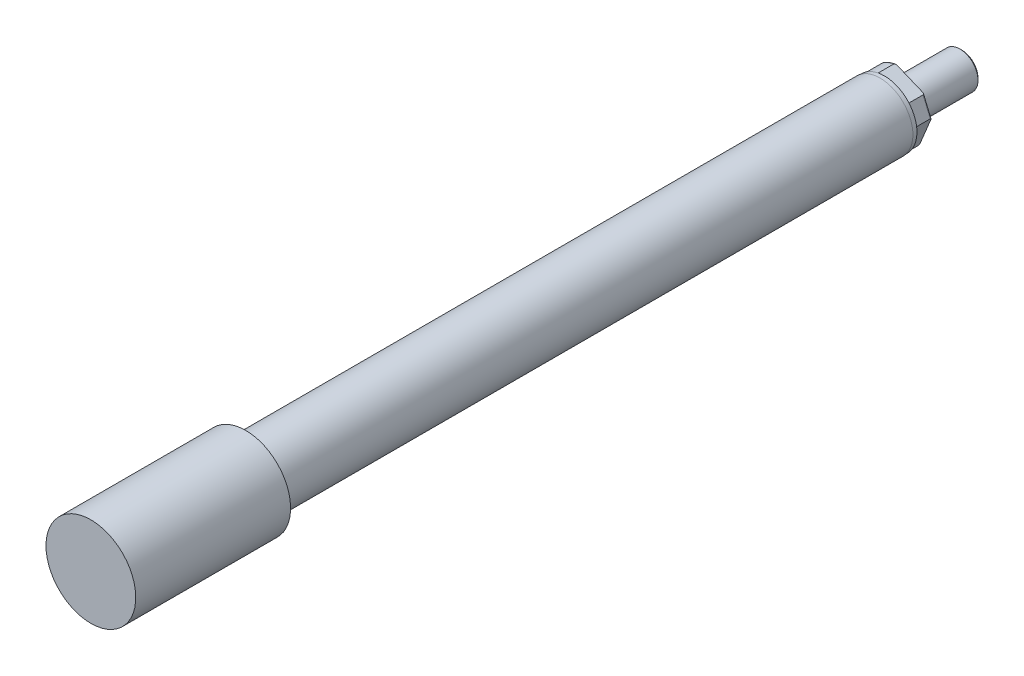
ISO-10303-21;
HEADER;
FILE_DESCRIPTION(('STEP AP214'),'2;1');
FILE_NAME('part.step','',(''),(''),'','','');
FILE_SCHEMA(('AUTOMOTIVE_DESIGN { 1 0 10303 214 1 1 1 1 }'));
ENDSEC;
DATA;
#1=APPLICATION_CONTEXT('core data for automotive mechanical design processes');
#2=APPLICATION_PROTOCOL_DEFINITION('international standard','automotive_design',2000,#1);
#3=PRODUCT_CONTEXT('',#1,'mechanical');
#4=PRODUCT('Part','Part','',(#3));
#5=PRODUCT_RELATED_PRODUCT_CATEGORY('part','',(#4));
#6=PRODUCT_DEFINITION_FORMATION('','',#4);
#7=PRODUCT_DEFINITION_CONTEXT('part definition',#1,'design');
#8=PRODUCT_DEFINITION('design','',#6,#7);
#9=PRODUCT_DEFINITION_SHAPE('','',#8);
#10=(LENGTH_UNIT() NAMED_UNIT(*) SI_UNIT(.MILLI.,.METRE.));
#11=(NAMED_UNIT(*) PLANE_ANGLE_UNIT() SI_UNIT($,.RADIAN.));
#12=(NAMED_UNIT(*) SI_UNIT($,.STERADIAN.) SOLID_ANGLE_UNIT());
#13=UNCERTAINTY_MEASURE_WITH_UNIT(LENGTH_MEASURE(1.E-05),#10,'distance_accuracy_value','');
#14=(GEOMETRIC_REPRESENTATION_CONTEXT(3) GLOBAL_UNCERTAINTY_ASSIGNED_CONTEXT((#13)) GLOBAL_UNIT_ASSIGNED_CONTEXT((#10,
#11,#12)) REPRESENTATION_CONTEXT('',''));
#15=CARTESIAN_POINT('',(0.,0.,0.));
#16=DIRECTION('',(0.,0.,1.));
#17=DIRECTION('',(1.,0.,0.));
#18=AXIS2_PLACEMENT_3D('',#15,#16,#17);
#19=CARTESIAN_POINT('',(0.,0.,-710.03280000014));
#20=DIRECTION('',(0.,0.,1.));
#21=DIRECTION('',(0.923879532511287,-0.382683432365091,0.));
#22=AXIS2_PLACEMENT_3D('',#19,#20,#21);
#23=CYLINDRICAL_SURFACE('',#22,37.719);
#24=CARTESIAN_POINT('',(0.,0.,-770.18000000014));
#25=DIRECTION('',(0.,0.,1.));
#26=DIRECTION('',(0.923879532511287,-0.382683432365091,0.));
#27=AXIS2_PLACEMENT_3D('',#24,#25,#26);
#28=CIRCLE('',#27,37.719);
#29=CARTESIAN_POINT('',(34.8478120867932,-14.4344363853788,-770.18000000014));
#30=VERTEX_POINT('',#29);
#31=EDGE_CURVE('E137',#30,#30,#28,.T.);
#32=ORIENTED_EDGE('',*,*,#31,.F.);
#33=EDGE_LOOP('',(#32));
#34=FACE_BOUND('',#33,.T.);
#35=CARTESIAN_POINT('',(0.,0.,-775.18000000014));
#36=DIRECTION('',(0.,0.,-1.));
#37=DIRECTION('',(-0.923879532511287,0.382683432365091,0.));
#38=AXIS2_PLACEMENT_3D('',#35,#36,#37);
#39=CIRCLE('',#38,37.719);
#40=CARTESIAN_POINT('',(-34.8478120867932,14.4344363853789,-775.18000000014));
#41=VERTEX_POINT('',#40);
#42=EDGE_CURVE('E173',#41,#41,#39,.T.);
#43=ORIENTED_EDGE('',*,*,#42,.F.);
#44=EDGE_LOOP('',(#43));
#45=FACE_BOUND('',#44,.T.);
#46=ADVANCED_FACE('F16',(#34,#45),#23,.T.);
#47=CARTESIAN_POINT('',(14.4344363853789,34.8478120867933,-795.18000000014));
#48=DIRECTION('',(0.,0.,1.));
#49=DIRECTION('',(0.923879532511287,-0.382683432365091,0.));
#50=AXIS2_PLACEMENT_3D('',#47,#48,#49);
#51=PLANE('',#50);
#52=CARTESIAN_POINT('',(0.,0.,-795.18000000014));
#53=DIRECTION('',(0.,0.,1.));
#54=DIRECTION('',(0.923879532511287,-0.382683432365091,0.));
#55=AXIS2_PLACEMENT_3D('',#52,#53,#54);
#56=CIRCLE('',#55,18.495999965);
#57=CARTESIAN_POINT('',(17.088075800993,-7.07811275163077,-795.18000000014));
#58=VERTEX_POINT('',#57);
#59=EDGE_CURVE('E158',#58,#58,#56,.T.);
#60=ORIENTED_EDGE('',*,*,#59,.T.);
#61=EDGE_LOOP('',(#60));
#62=FACE_BOUND('',#61,.T.);
#63=DIRECTION('',(0.923879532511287,-0.382683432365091,0.));
#64=VECTOR('',#63,1.);
#65=CARTESIAN_POINT('',(40.5034519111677,16.7770791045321,-795.18000000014));
#66=LINE('',#65,#64);
#67=CARTESIAN_POINT('',(-4.93911886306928,35.6000082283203,-795.18000000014));
#68=VERTEX_POINT('',#67);
#69=CARTESIAN_POINT('',(24.3744280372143,23.4579395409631,-795.18000000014));
#70=VERTEX_POINT('',#69);
#71=EDGE_CURVE('E153',#68,#70,#66,.T.);
#72=ORIENTED_EDGE('',*,*,#71,.T.);
#73=DIRECTION('',(-0.382683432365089,0.923879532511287,0.));
#74=VECTOR('',#73,1.);
#75=CARTESIAN_POINT('',(18.8918219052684,36.6941216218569,-795.18000000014));
#76=LINE('',#75,#74);
#77=CARTESIAN_POINT('',(33.8225914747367,0.648055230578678,-795.18000000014));
#78=VERTEX_POINT('',#77);
#79=EDGE_CURVE('E269',#70,#78,#76,.F.);
#80=ORIENTED_EDGE('',*,*,#79,.T.);
#81=DIRECTION('',(-0.382683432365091,-0.923879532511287,0.));
#82=VECTOR('',#81,1.);
#83=CARTESIAN_POINT('',(40.5034519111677,16.7770791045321,-795.18000000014));
#84=LINE('',#83,#82);
#85=CARTESIAN_POINT('',(21.6805227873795,-28.6654916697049,-795.18000000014));
#86=VERTEX_POINT('',#85);
#87=EDGE_CURVE('E143',#78,#86,#84,.T.);
#88=ORIENTED_EDGE('',*,*,#87,.T.);
#89=CARTESIAN_POINT('',(0.,0.,-795.18000000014));
#90=DIRECTION('',(0.,0.,1.));
#91=DIRECTION('',(0.923879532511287,-0.382683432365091,0.));
#92=AXIS2_PLACEMENT_3D('',#89,#90,#91);
#93=CIRCLE('',#92,35.941);
#94=CARTESIAN_POINT('',(4.93911886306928,-35.6000082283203,-795.18000000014));
#95=VERTEX_POINT('',#94);
#96=EDGE_CURVE('E284',#86,#95,#93,.F.);
#97=ORIENTED_EDGE('',*,*,#96,.T.);
#98=DIRECTION('',(-0.923879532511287,0.382683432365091,0.));
#99=VECTOR('',#98,1.);
#100=CARTESIAN_POINT('',(16.7770791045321,-40.5034519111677,-795.18000000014));
#101=LINE('',#100,#99);
#102=CARTESIAN_POINT('',(-28.6654916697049,-21.6805227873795,-795.18000000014));
#103=VERTEX_POINT('',#102);
#104=EDGE_CURVE('E146',#95,#103,#101,.T.);
#105=ORIENTED_EDGE('',*,*,#104,.T.);
#106=CARTESIAN_POINT('',(0.,0.,-795.18000000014));
#107=DIRECTION('',(0.,0.,1.));
#108=DIRECTION('',(0.923879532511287,-0.382683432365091,0.));
#109=AXIS2_PLACEMENT_3D('',#106,#107,#108);
#110=CIRCLE('',#109,35.941);
#111=CARTESIAN_POINT('',(-35.6000082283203,-4.93911886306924,-795.18000000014));
#112=VERTEX_POINT('',#111);
#113=EDGE_CURVE('E282',#103,#112,#110,.F.);
#114=ORIENTED_EDGE('',*,*,#113,.T.);
#115=DIRECTION('',(0.382683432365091,0.923879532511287,0.));
#116=VECTOR('',#115,1.);
#117=CARTESIAN_POINT('',(-16.777079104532,40.5034519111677,-795.18000000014));
#118=LINE('',#117,#116);
#119=CARTESIAN_POINT('',(-21.6805227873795,28.6654916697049,-795.18000000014));
#120=VERTEX_POINT('',#119);
#121=EDGE_CURVE('E150',#112,#120,#118,.T.);
#122=ORIENTED_EDGE('',*,*,#121,.T.);
#123=CARTESIAN_POINT('',(0.,0.,-795.18000000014));
#124=DIRECTION('',(0.,0.,1.));
#125=DIRECTION('',(0.923879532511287,-0.382683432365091,0.));
#126=AXIS2_PLACEMENT_3D('',#123,#124,#125);
#127=CIRCLE('',#126,35.941);
#128=EDGE_CURVE('E285',#120,#68,#127,.F.);
#129=ORIENTED_EDGE('',*,*,#128,.T.);
#130=EDGE_LOOP('',(#72,#80,#88,#97,#105,#114,#122,#129));
#131=FACE_BOUND('',#130,.T.);
#132=ADVANCED_FACE('F235',(#62,#131),#51,.F.);
#133=CARTESIAN_POINT('',(16.7770791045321,-40.5034519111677,-775.18000000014));
#134=DIRECTION('',(-0.382683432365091,-0.923879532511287,0.));
#135=DIRECTION('',(0.,0.,-1.));
#136=AXIS2_PLACEMENT_3D('',#133,#134,#135);
#137=PLANE('',#136);
#138=ORIENTED_EDGE('',*,*,#104,.F.);
#139=CARTESIAN_POINT('',(4.93911886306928,-35.6000082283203,-795.18000000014));
#140=CARTESIAN_POINT('',(4.99832987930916,-35.6245342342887,-795.179997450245));
#141=CARTESIAN_POINT('',(5.05753718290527,-35.6490587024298,-795.178965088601));
#142=CARTESIAN_POINT('',(5.17589592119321,-35.698084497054,-795.174771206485));
#143=CARTESIAN_POINT('',(5.23504734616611,-35.7225858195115,-795.171609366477));
#144=CARTESIAN_POINT('',(5.41269190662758,-35.7961686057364,-795.158798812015));
#145=CARTESIAN_POINT('',(5.53100031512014,-35.8451735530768,-795.145824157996));
#146=CARTESIAN_POINT('',(5.76714438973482,-35.9429876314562,-795.110075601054));
#147=CARTESIAN_POINT('',(5.88497196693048,-35.9917934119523,-795.087238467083));
#148=CARTESIAN_POINT('',(6.11821347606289,-36.0884052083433,-795.030530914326));
#149=CARTESIAN_POINT('',(6.23363092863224,-36.1362126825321,-794.996677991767));
#150=CARTESIAN_POINT('',(6.43254813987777,-36.2186068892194,-794.926075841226));
#151=CARTESIAN_POINT('',(6.51688700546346,-36.2535411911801,-794.89210972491));
#152=CARTESIAN_POINT('',(6.68230923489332,-36.322061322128,-794.815821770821));
#153=CARTESIAN_POINT('',(6.76339350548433,-36.3556475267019,-794.773502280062));
#154=CARTESIAN_POINT('',(6.92130537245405,-36.4210567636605,-794.678775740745));
#155=CARTESIAN_POINT('',(6.99809311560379,-36.4528632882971,-794.626289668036));
#156=CARTESIAN_POINT('',(7.14387346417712,-36.5132474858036,-794.509776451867));
#157=CARTESIAN_POINT('',(7.21288086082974,-36.5418312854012,-794.445771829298));
#158=CARTESIAN_POINT('',(7.31526105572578,-36.5842385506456,-794.330741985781));
#159=CARTESIAN_POINT('',(7.35238511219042,-36.5996158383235,-794.283646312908));
#160=CARTESIAN_POINT('',(7.41994876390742,-36.6276016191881,-794.184077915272));
#161=CARTESIAN_POINT('',(7.45039435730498,-36.6402125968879,-794.131610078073));
#162=CARTESIAN_POINT('',(7.49865078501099,-36.6602010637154,-794.029833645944));
#163=CARTESIAN_POINT('',(7.51766185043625,-36.6680757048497,-793.981197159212));
#164=CARTESIAN_POINT('',(7.54789053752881,-36.6805968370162,-793.8811948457));
#165=CARTESIAN_POINT('',(7.55912658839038,-36.6852509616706,-793.829835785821));
#166=CARTESIAN_POINT('',(7.56865990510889,-36.6891997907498,-793.757679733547));
#167=CARTESIAN_POINT('',(7.57066753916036,-36.6900313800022,-793.737405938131));
#168=CARTESIAN_POINT('',(7.57334922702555,-36.691142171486,-793.696758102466));
#169=CARTESIAN_POINT('',(7.57402345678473,-36.6914214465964,-793.676384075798));
#170=CARTESIAN_POINT('',(7.57402314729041,-36.6914213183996,-793.65600000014));
#171=B_SPLINE_CURVE_WITH_KNOTS('',3,(#139,#140,#141,#142,#143,#144,#145,#146,#147,#148,#149,
#150,#151,#152,#153,#154,#155,#156,#157,#158,#159,#160,#161,#162,#163,#164,#165,#166,#167,#168,
#169,#170),.UNSPECIFIED.,.F.,.F.,(4,2,2,2,2,2,2,2,2,2,2,2,2,2,2,4),(0.,0.19225105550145,
0.384530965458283,0.770306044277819,1.15859203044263,1.54626429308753,1.83813426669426,
2.12992235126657,2.42407675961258,2.71766216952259,2.90288017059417,3.08793113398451,
3.24573831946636,3.40317015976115,3.46429781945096,3.52541741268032),.UNSPECIFIED.);
#172=CARTESIAN_POINT('',(7.5740231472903,-36.6914213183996,-793.65600000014));
#173=VERTEX_POINT('',#172);
#174=EDGE_CURVE('E248',#95,#173,#171,.T.);
#175=ORIENTED_EDGE('',*,*,#174,.T.);
#176=DIRECTION('',(0.,0.,-1.));
#177=VECTOR('',#176,1.);
#178=CARTESIAN_POINT('',(7.5740231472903,-36.6914213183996,-667.427702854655));
#179=LINE('',#178,#177);
#180=CARTESIAN_POINT('',(7.5740231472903,-36.6914213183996,-775.18000000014));
#181=VERTEX_POINT('',#180);
#182=EDGE_CURVE('E316',#173,#181,#179,.F.);
#183=ORIENTED_EDGE('',*,*,#182,.T.);
#184=DIRECTION('',(-0.923879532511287,0.382683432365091,0.));
#185=VECTOR('',#184,1.);
#186=CARTESIAN_POINT('',(16.7770791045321,-40.5034519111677,-775.18000000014));
#187=LINE('',#186,#185);
#188=CARTESIAN_POINT('',(-31.3003959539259,-20.5891096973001,-775.18000000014));
#189=VERTEX_POINT('',#188);
#190=EDGE_CURVE('E134',#181,#189,#187,.T.);
#191=ORIENTED_EDGE('',*,*,#190,.T.);
#192=DIRECTION('',(0.,0.,-1.));
#193=VECTOR('',#192,1.);
#194=CARTESIAN_POINT('',(-31.3003959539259,-20.5891096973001,-667.427702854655));
#195=LINE('',#194,#193);
#196=CARTESIAN_POINT('',(-31.3003959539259,-20.5891096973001,-793.65600000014));
#197=VERTEX_POINT('',#196);
#198=EDGE_CURVE('E121',#189,#197,#195,.T.);
#199=ORIENTED_EDGE('',*,*,#198,.T.);
#200=CARTESIAN_POINT('',(-31.3003959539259,-20.5891096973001,-793.65600000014));
#201=CARTESIAN_POINT('',(-31.3004118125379,-20.5891031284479,-793.686203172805));
#202=CARTESIAN_POINT('',(-31.2989193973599,-20.5897213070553,-793.716395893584));
#203=CARTESIAN_POINT('',(-31.2930415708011,-20.5921559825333,-793.776407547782));
#204=CARTESIAN_POINT('',(-31.2886603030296,-20.5939707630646,-793.806226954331));
#205=CARTESIAN_POINT('',(-31.2772021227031,-20.598716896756,-793.864846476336));
#206=CARTESIAN_POINT('',(-31.270160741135,-20.6016335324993,-793.893654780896));
#207=CARTESIAN_POINT('',(-31.2535839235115,-20.60849987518,-793.950415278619));
#208=CARTESIAN_POINT('',(-31.2440477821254,-20.6124498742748,-793.978367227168));
#209=CARTESIAN_POINT('',(-31.2121642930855,-20.6256564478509,-794.060335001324));
#210=CARTESIAN_POINT('',(-31.1864612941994,-20.6363029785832,-794.112849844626));
#211=CARTESIAN_POINT('',(-31.127980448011,-20.6605265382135,-794.213146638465));
#212=CARTESIAN_POINT('',(-31.0951775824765,-20.6741139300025,-794.260910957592));
#213=CARTESIAN_POINT('',(-31.003724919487,-20.7119948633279,-794.377743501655));
#214=CARTESIAN_POINT('',(-30.941099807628,-20.7379350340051,-794.443153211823));
#215=CARTESIAN_POINT('',(-30.807443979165,-20.7932970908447,-794.562855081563));
#216=CARTESIAN_POINT('',(-30.7363963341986,-20.8227259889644,-794.617124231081));
#217=CARTESIAN_POINT('',(-30.5996359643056,-20.8793739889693,-794.708806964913));
#218=CARTESIAN_POINT('',(-30.5346551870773,-20.9062899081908,-794.747524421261));
#219=CARTESIAN_POINT('',(-30.4018382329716,-20.9613044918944,-794.818793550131));
#220=CARTESIAN_POINT('',(-30.33399999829,-20.989404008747,-794.851340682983));
#221=CARTESIAN_POINT('',(-30.1960424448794,-21.0465478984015,-794.911059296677));
#222=CARTESIAN_POINT('',(-30.1259151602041,-21.0755955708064,-794.938208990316));
#223=CARTESIAN_POINT('',(-29.9841814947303,-21.1343035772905,-794.987552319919));
#224=CARTESIAN_POINT('',(-29.9125747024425,-21.1639640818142,-795.00974455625));
#225=CARTESIAN_POINT('',(-29.7438693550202,-21.2338441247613,-795.056387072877));
#226=CARTESIAN_POINT('',(-29.6463506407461,-21.2742376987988,-795.079056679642));
#227=CARTESIAN_POINT('',(-29.4500861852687,-21.3555330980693,-795.117195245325));
#228=CARTESIAN_POINT('',(-29.351339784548,-21.3964351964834,-795.132660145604));
#229=CARTESIAN_POINT('',(-29.1548151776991,-21.4778383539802,-795.156800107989));
#230=CARTESIAN_POINT('',(-29.0570481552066,-21.5183347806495,-795.165583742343));
#231=CARTESIAN_POINT('',(-28.861343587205,-21.5993982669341,-795.177167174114));
#232=CARTESIAN_POINT('',(-28.7634064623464,-21.6399651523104,-795.17997520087));
#233=CARTESIAN_POINT('',(-28.6654916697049,-21.6805227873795,-795.18000000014));
#234=B_SPLINE_CURVE_WITH_KNOTS('',3,(#200,#201,#202,#203,#204,#205,#206,#207,#208,#209,#210,
#211,#212,#213,#214,#215,#216,#217,#218,#219,#220,#221,#222,#223,#224,#225,#226,#227,#228,#229,
#230,#231,#232,#233),.UNSPECIFIED.,.F.,.F.,(4,2,2,2,2,2,2,2,2,2,2,2,2,2,2,2,4),(0.,
0.0905495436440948,0.180969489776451,0.270222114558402,0.359500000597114,0.53688322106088,
0.714901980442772,0.995893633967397,1.27745994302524,1.51798351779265,1.75868337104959,
2.00033593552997,2.24205663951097,2.56564116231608,2.88940775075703,3.20779349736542,
3.52574049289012),.UNSPECIFIED.);
#235=EDGE_CURVE('E242',#197,#103,#234,.T.);
#236=ORIENTED_EDGE('',*,*,#235,.T.);
#237=EDGE_LOOP('',(#138,#175,#183,#191,#199,#236));
#238=FACE_BOUND('',#237,.T.);
#239=ADVANCED_FACE('F230',(#238),#137,.T.);
#240=CARTESIAN_POINT('',(-16.777079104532,40.5034519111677,-775.18000000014));
#241=DIRECTION('',(-0.923879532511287,0.382683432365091,0.));
#242=DIRECTION('',(-0.382683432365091,-0.923879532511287,0.));
#243=AXIS2_PLACEMENT_3D('',#240,#241,#242);
#244=PLANE('',#243);
#245=ORIENTED_EDGE('',*,*,#121,.F.);
#246=CARTESIAN_POINT('',(-35.6000082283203,-4.93911886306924,-795.18000000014));
#247=CARTESIAN_POINT('',(-35.6245342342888,-4.99832987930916,-795.179997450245));
#248=CARTESIAN_POINT('',(-35.6490587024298,-5.0575371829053,-795.178965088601));
#249=CARTESIAN_POINT('',(-35.6980844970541,-5.17589592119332,-795.174771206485));
#250=CARTESIAN_POINT('',(-35.7225858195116,-5.23504734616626,-795.171609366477));
#251=CARTESIAN_POINT('',(-35.7961686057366,-5.41269190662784,-795.158798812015));
#252=CARTESIAN_POINT('',(-35.845173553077,-5.53100031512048,-795.145824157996));
#253=CARTESIAN_POINT('',(-35.9429876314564,-5.76714438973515,-795.110075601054));
#254=CARTESIAN_POINT('',(-35.9917934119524,-5.88497196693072,-795.087238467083));
#255=CARTESIAN_POINT('',(-36.0884052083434,-6.11821347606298,-795.030530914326));
#256=CARTESIAN_POINT('',(-36.1362126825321,-6.23363092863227,-794.996677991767));
#257=CARTESIAN_POINT('',(-36.2186068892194,-6.43254813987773,-794.926075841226));
#258=CARTESIAN_POINT('',(-36.2535411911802,-6.5168870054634,-794.89210972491));
#259=CARTESIAN_POINT('',(-36.322061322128,-6.68230923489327,-794.815821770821));
#260=CARTESIAN_POINT('',(-36.355647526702,-6.76339350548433,-794.773502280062));
#261=CARTESIAN_POINT('',(-36.4210567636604,-6.9213053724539,-794.678775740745));
#262=CARTESIAN_POINT('',(-36.452863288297,-6.99809311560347,-794.626289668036));
#263=CARTESIAN_POINT('',(-36.5132474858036,-7.14387346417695,-794.509776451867));
#264=CARTESIAN_POINT('',(-36.5418312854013,-7.21288086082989,-794.445771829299));
#265=CARTESIAN_POINT('',(-36.5842385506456,-7.31526105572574,-794.330741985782));
#266=CARTESIAN_POINT('',(-36.5996158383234,-7.35238511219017,-794.283646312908));
#267=CARTESIAN_POINT('',(-36.627601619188,-7.41994876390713,-794.184077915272));
#268=CARTESIAN_POINT('',(-36.6402125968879,-7.45039435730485,-794.131610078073));
#269=CARTESIAN_POINT('',(-36.6602010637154,-7.49865078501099,-794.029833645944));
#270=CARTESIAN_POINT('',(-36.6680757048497,-7.51766185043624,-793.981197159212));
#271=CARTESIAN_POINT('',(-36.6805968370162,-7.54789053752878,-793.8811948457));
#272=CARTESIAN_POINT('',(-36.6852509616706,-7.55912658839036,-793.829835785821));
#273=CARTESIAN_POINT('',(-36.6891997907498,-7.56865990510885,-793.757679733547));
#274=CARTESIAN_POINT('',(-36.6900313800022,-7.57066753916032,-793.737405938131));
#275=CARTESIAN_POINT('',(-36.691142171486,-7.5733492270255,-793.696758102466));
#276=CARTESIAN_POINT('',(-36.6914214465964,-7.57402345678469,-793.676384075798));
#277=CARTESIAN_POINT('',(-36.6914213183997,-7.57402314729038,-793.65600000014));
#278=B_SPLINE_CURVE_WITH_KNOTS('',3,(#246,#247,#248,#249,#250,#251,#252,#253,#254,#255,#256,
#257,#258,#259,#260,#261,#262,#263,#264,#265,#266,#267,#268,#269,#270,#271,#272,#273,#274,#275,
#276,#277),.UNSPECIFIED.,.F.,.F.,(4,2,2,2,2,2,2,2,2,2,2,2,2,2,2,4),(0.,0.192251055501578,
0.384530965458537,0.770306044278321,1.15859203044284,1.54626429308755,1.83813426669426,
2.12992235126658,2.4240767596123,2.71766216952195,2.90288017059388,3.08793113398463,
3.24573831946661,3.40317015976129,3.46429781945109,3.52541741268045),.UNSPECIFIED.);
#279=CARTESIAN_POINT('',(-36.6914213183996,-7.57402314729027,-793.65600000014));
#280=VERTEX_POINT('',#279);
#281=EDGE_CURVE('E33',#112,#280,#278,.T.);
#282=ORIENTED_EDGE('',*,*,#281,.T.);
#283=DIRECTION('',(0.,0.,-1.));
#284=VECTOR('',#283,1.);
#285=CARTESIAN_POINT('',(-36.6914213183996,-7.57402314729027,-667.427702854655));
#286=LINE('',#285,#284);
#287=CARTESIAN_POINT('',(-36.6914213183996,-7.57402314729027,-775.18000000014));
#288=VERTEX_POINT('',#287);
#289=EDGE_CURVE('E107',#280,#288,#286,.F.);
#290=ORIENTED_EDGE('',*,*,#289,.T.);
#291=DIRECTION('',(0.382683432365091,0.923879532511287,0.));
#292=VECTOR('',#291,1.);
#293=CARTESIAN_POINT('',(-16.777079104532,40.5034519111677,-775.18000000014));
#294=LINE('',#293,#292);
#295=CARTESIAN_POINT('',(-20.5891096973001,31.3003959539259,-775.18000000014));
#296=VERTEX_POINT('',#295);
#297=EDGE_CURVE('E111',#288,#296,#294,.T.);
#298=ORIENTED_EDGE('',*,*,#297,.T.);
#299=DIRECTION('',(0.,0.,-1.));
#300=VECTOR('',#299,1.);
#301=CARTESIAN_POINT('',(-20.5891096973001,31.3003959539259,-667.427702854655));
#302=LINE('',#301,#300);
#303=CARTESIAN_POINT('',(-20.5891096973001,31.3003959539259,-793.65600000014));
#304=VERTEX_POINT('',#303);
#305=EDGE_CURVE('E114',#296,#304,#302,.T.);
#306=ORIENTED_EDGE('',*,*,#305,.T.);
#307=CARTESIAN_POINT('',(-20.5891096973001,31.3003959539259,-793.65600000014));
#308=CARTESIAN_POINT('',(-20.5891031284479,31.300411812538,-793.686203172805));
#309=CARTESIAN_POINT('',(-20.5897213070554,31.29891939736,-793.716395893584));
#310=CARTESIAN_POINT('',(-20.5921559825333,31.2930415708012,-793.776407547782));
#311=CARTESIAN_POINT('',(-20.5939707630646,31.2886603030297,-793.806226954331));
#312=CARTESIAN_POINT('',(-20.598716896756,31.2772021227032,-793.864846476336));
#313=CARTESIAN_POINT('',(-20.6016335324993,31.2701607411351,-793.893654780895));
#314=CARTESIAN_POINT('',(-20.60849987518,31.2535839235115,-793.950415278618));
#315=CARTESIAN_POINT('',(-20.6124498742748,31.2440477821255,-793.978367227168));
#316=CARTESIAN_POINT('',(-20.6256564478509,31.2121642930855,-794.060335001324));
#317=CARTESIAN_POINT('',(-20.6363029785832,31.1864612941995,-794.112849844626));
#318=CARTESIAN_POINT('',(-20.6605265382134,31.1279804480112,-794.213146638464));
#319=CARTESIAN_POINT('',(-20.6741139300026,31.0951775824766,-794.260910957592));
#320=CARTESIAN_POINT('',(-20.711994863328,31.0037249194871,-794.377743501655));
#321=CARTESIAN_POINT('',(-20.7379350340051,30.941099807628,-794.443153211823));
#322=CARTESIAN_POINT('',(-20.7932970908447,30.807443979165,-794.562855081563));
#323=CARTESIAN_POINT('',(-20.8227259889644,30.7363963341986,-794.617124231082));
#324=CARTESIAN_POINT('',(-20.8793739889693,30.5996359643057,-794.708806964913));
#325=CARTESIAN_POINT('',(-20.9062899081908,30.5346551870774,-794.747524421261));
#326=CARTESIAN_POINT('',(-20.9613044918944,30.4018382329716,-794.81879355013));
#327=CARTESIAN_POINT('',(-20.989404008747,30.33399999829,-794.851340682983));
#328=CARTESIAN_POINT('',(-21.0465478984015,30.1960424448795,-794.911059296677));
#329=CARTESIAN_POINT('',(-21.0755955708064,30.1259151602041,-794.938208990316));
#330=CARTESIAN_POINT('',(-21.1343035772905,29.9841814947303,-794.987552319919));
#331=CARTESIAN_POINT('',(-21.1639640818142,29.9125747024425,-795.00974455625));
#332=CARTESIAN_POINT('',(-21.2338441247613,29.7438693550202,-795.056387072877));
#333=CARTESIAN_POINT('',(-21.2742376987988,29.6463506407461,-795.079056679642));
#334=CARTESIAN_POINT('',(-21.3555330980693,29.4500861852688,-795.117195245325));
#335=CARTESIAN_POINT('',(-21.3964351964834,29.3513397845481,-795.132660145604));
#336=CARTESIAN_POINT('',(-21.4778383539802,29.1548151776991,-795.156800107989));
#337=CARTESIAN_POINT('',(-21.5183347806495,29.0570481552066,-795.165583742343));
#338=CARTESIAN_POINT('',(-21.5993982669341,28.861343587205,-795.177167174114));
#339=CARTESIAN_POINT('',(-21.6399651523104,28.7634064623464,-795.17997520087));
#340=CARTESIAN_POINT('',(-21.6805227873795,28.6654916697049,-795.18000000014));
#341=B_SPLINE_CURVE_WITH_KNOTS('',3,(#307,#308,#309,#310,#311,#312,#313,#314,#315,#316,#317,
#318,#319,#320,#321,#322,#323,#324,#325,#326,#327,#328,#329,#330,#331,#332,#333,#334,#335,#336,
#337,#338,#339,#340),.UNSPECIFIED.,.F.,.F.,(4,2,2,2,2,2,2,2,2,2,2,2,2,2,2,2,4),(0.,
0.0905495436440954,0.18096948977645,0.270222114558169,0.359500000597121,0.536883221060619,
0.714901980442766,0.995893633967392,1.27745994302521,1.51798351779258,1.75868337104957,
2.00033593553,2.24205663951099,2.56564116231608,2.88940775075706,3.20779349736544,
3.52574049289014),.UNSPECIFIED.);
#342=EDGE_CURVE('E213',#304,#120,#341,.T.);
#343=ORIENTED_EDGE('',*,*,#342,.T.);
#344=EDGE_LOOP('',(#245,#282,#290,#298,#306,#343));
#345=FACE_BOUND('',#344,.T.);
#346=ADVANCED_FACE('F109',(#345),#244,.T.);
#347=CARTESIAN_POINT('',(40.5034519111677,16.7770791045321,-775.18000000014));
#348=DIRECTION('',(0.382683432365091,0.923879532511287,0.));
#349=DIRECTION('',(0.,0.,1.));
#350=AXIS2_PLACEMENT_3D('',#347,#348,#349);
#351=PLANE('',#350);
#352=DIRECTION('',(0.,0.,1.));
#353=VECTOR('',#352,1.);
#354=CARTESIAN_POINT('',(26.3656299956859,22.6331566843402,-775.18000000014));
#355=LINE('',#354,#353);
#356=CARTESIAN_POINT('',(26.3656299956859,22.6331566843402,-793.65600000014));
#357=VERTEX_POINT('',#356);
#358=CARTESIAN_POINT('',(26.3656299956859,22.6331566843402,-775.18000000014));
#359=VERTEX_POINT('',#358);
#360=EDGE_CURVE('E292',#357,#359,#355,.T.);
#361=ORIENTED_EDGE('',*,*,#360,.F.);
#362=CARTESIAN_POINT('',(24.3744280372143,23.4579395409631,-793.65600000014));
#363=DIRECTION('',(0.382683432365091,0.923879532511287,0.));
#364=DIRECTION('',(-0.923879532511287,0.382683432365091,0.));
#365=AXIS2_PLACEMENT_3D('',#362,#363,#364);
#366=ELLIPSE('',#365,2.15526146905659,1.524);
#367=EDGE_CURVE('E193',#357,#70,#366,.T.);
#368=ORIENTED_EDGE('',*,*,#367,.T.);
#369=ORIENTED_EDGE('',*,*,#71,.F.);
#370=CARTESIAN_POINT('',(-4.93911886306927,35.6000082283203,-795.18000000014));
#371=CARTESIAN_POINT('',(-4.99832987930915,35.6245342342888,-795.179997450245));
#372=CARTESIAN_POINT('',(-5.05753718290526,35.6490587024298,-795.178965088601));
#373=CARTESIAN_POINT('',(-5.17589592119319,35.6980844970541,-795.174771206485));
#374=CARTESIAN_POINT('',(-5.23504734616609,35.7225858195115,-795.171609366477));
#375=CARTESIAN_POINT('',(-5.41269190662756,35.7961686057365,-795.158798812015));
#376=CARTESIAN_POINT('',(-5.53100031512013,35.8451735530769,-795.145824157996));
#377=CARTESIAN_POINT('',(-5.7671443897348,35.9429876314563,-795.110075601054));
#378=CARTESIAN_POINT('',(-5.88497196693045,35.9917934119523,-795.087238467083));
#379=CARTESIAN_POINT('',(-6.11821347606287,36.0884052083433,-795.030530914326));
#380=CARTESIAN_POINT('',(-6.23363092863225,36.1362126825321,-794.996677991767));
#381=CARTESIAN_POINT('',(-6.43254813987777,36.2186068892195,-794.926075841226));
#382=CARTESIAN_POINT('',(-6.51688700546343,36.2535411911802,-794.89210972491));
#383=CARTESIAN_POINT('',(-6.68230923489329,36.322061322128,-794.815821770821));
#384=CARTESIAN_POINT('',(-6.76339350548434,36.355647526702,-794.773502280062));
#385=CARTESIAN_POINT('',(-6.92130537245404,36.4210567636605,-794.678775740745));
#386=CARTESIAN_POINT('',(-6.99809311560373,36.4528632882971,-794.626289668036));
#387=CARTESIAN_POINT('',(-7.14387346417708,36.5132474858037,-794.509776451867));
#388=CARTESIAN_POINT('',(-7.21288086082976,36.5418312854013,-794.445771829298));
#389=CARTESIAN_POINT('',(-7.31526105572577,36.5842385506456,-794.330741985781));
#390=CARTESIAN_POINT('',(-7.35238511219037,36.5996158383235,-794.283646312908));
#391=CARTESIAN_POINT('',(-7.41994876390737,36.6276016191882,-794.184077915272));
#392=CARTESIAN_POINT('',(-7.45039435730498,36.640212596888,-794.131610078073));
#393=CARTESIAN_POINT('',(-7.49865078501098,36.6602010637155,-794.029833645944));
#394=CARTESIAN_POINT('',(-7.51766185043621,36.6680757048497,-793.981197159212));
#395=CARTESIAN_POINT('',(-7.54789053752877,36.6805968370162,-793.8811948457));
#396=CARTESIAN_POINT('',(-7.55912658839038,36.6852509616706,-793.829835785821));
#397=CARTESIAN_POINT('',(-7.56865990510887,36.6891997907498,-793.757679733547));
#398=CARTESIAN_POINT('',(-7.57066753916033,36.6900313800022,-793.737405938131));
#399=CARTESIAN_POINT('',(-7.5733492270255,36.691142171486,-793.696758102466));
#400=CARTESIAN_POINT('',(-7.57402345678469,36.6914214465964,-793.676384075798));
#401=CARTESIAN_POINT('',(-7.5740231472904,36.6914213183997,-793.65600000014));
#402=B_SPLINE_CURVE_WITH_KNOTS('',3,(#370,#371,#372,#373,#374,#375,#376,#377,#378,#379,#380,
#381,#382,#383,#384,#385,#386,#387,#388,#389,#390,#391,#392,#393,#394,#395,#396,#397,#398,#399,
#400,#401),.UNSPECIFIED.,.F.,.F.,(4,2,2,2,2,2,2,2,2,2,2,2,2,2,2,4),(0.,0.192251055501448,
0.384530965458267,0.770306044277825,1.15859203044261,1.54626429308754,1.83813426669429,
2.12992235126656,2.42407675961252,2.71766216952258,2.90288017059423,3.08793113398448,
3.24573831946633,3.40317015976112,3.46429781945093,3.52541741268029),.UNSPECIFIED.);
#403=CARTESIAN_POINT('',(-7.57402314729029,36.6914213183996,-793.65600000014));
#404=VERTEX_POINT('',#403);
#405=EDGE_CURVE('E185',#68,#404,#402,.T.);
#406=ORIENTED_EDGE('',*,*,#405,.T.);
#407=DIRECTION('',(0.,0.,-1.));
#408=VECTOR('',#407,1.);
#409=CARTESIAN_POINT('',(-7.57402314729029,36.6914213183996,-667.427702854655));
#410=LINE('',#409,#408);
#411=CARTESIAN_POINT('',(-7.57402314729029,36.6914213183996,-775.18000000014));
#412=VERTEX_POINT('',#411);
#413=EDGE_CURVE('E115',#404,#412,#410,.F.);
#414=ORIENTED_EDGE('',*,*,#413,.T.);
#415=DIRECTION('',(0.923879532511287,-0.382683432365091,0.));
#416=VECTOR('',#415,1.);
#417=CARTESIAN_POINT('',(40.5034519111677,16.7770791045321,-775.18000000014));
#418=LINE('',#417,#416);
#419=EDGE_CURVE('E133',#412,#359,#418,.T.);
#420=ORIENTED_EDGE('',*,*,#419,.T.);
#421=EDGE_LOOP('',(#361,#368,#369,#406,#414,#420));
#422=FACE_BOUND('',#421,.T.);
#423=ADVANCED_FACE('F195',(#422),#351,.T.);
#424=CARTESIAN_POINT('',(40.5034519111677,16.7770791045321,-775.18000000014));
#425=DIRECTION('',(0.923879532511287,-0.382683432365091,0.));
#426=DIRECTION('',(0.382683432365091,0.923879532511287,0.));
#427=AXIS2_PLACEMENT_3D('',#424,#425,#426);
#428=PLANE('',#427);
#429=ORIENTED_EDGE('',*,*,#87,.F.);
#430=CARTESIAN_POINT('',(33.8225914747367,0.648055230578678,-793.65600000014));
#431=DIRECTION('',(0.923879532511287,-0.382683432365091,0.));
#432=DIRECTION('',(0.382683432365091,0.923879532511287,0.));
#433=AXIS2_PLACEMENT_3D('',#430,#431,#432);
#434=ELLIPSE('',#433,2.15526146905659,1.524);
#435=CARTESIAN_POINT('',(34.6473743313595,2.63925718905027,-793.65600000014));
#436=VERTEX_POINT('',#435);
#437=EDGE_CURVE('E268',#78,#436,#434,.T.);
#438=ORIENTED_EDGE('',*,*,#437,.T.);
#439=DIRECTION('',(0.,0.,-1.));
#440=VECTOR('',#439,1.);
#441=CARTESIAN_POINT('',(34.6473743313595,2.63925718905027,-775.18000000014));
#442=LINE('',#441,#440);
#443=CARTESIAN_POINT('',(34.6473743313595,2.63925718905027,-775.18000000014));
#444=VERTEX_POINT('',#443);
#445=EDGE_CURVE('E176',#444,#436,#442,.T.);
#446=ORIENTED_EDGE('',*,*,#445,.F.);
#447=DIRECTION('',(-0.382683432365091,-0.923879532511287,0.));
#448=VECTOR('',#447,1.);
#449=CARTESIAN_POINT('',(40.5034519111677,16.7770791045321,-775.18000000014));
#450=LINE('',#449,#448);
#451=CARTESIAN_POINT('',(20.5891096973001,-31.3003959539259,-775.18000000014));
#452=VERTEX_POINT('',#451);
#453=EDGE_CURVE('E139',#444,#452,#450,.T.);
#454=ORIENTED_EDGE('',*,*,#453,.T.);
#455=DIRECTION('',(0.,0.,-1.));
#456=VECTOR('',#455,1.);
#457=CARTESIAN_POINT('',(20.5891096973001,-31.3003959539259,-667.427702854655));
#458=LINE('',#457,#456);
#459=CARTESIAN_POINT('',(20.5891096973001,-31.3003959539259,-793.65600000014));
#460=VERTEX_POINT('',#459);
#461=EDGE_CURVE('E179',#452,#460,#458,.T.);
#462=ORIENTED_EDGE('',*,*,#461,.T.);
#463=CARTESIAN_POINT('',(20.5891096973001,-31.3003959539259,-793.65600000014));
#464=CARTESIAN_POINT('',(20.589103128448,-31.3004118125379,-793.686203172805));
#465=CARTESIAN_POINT('',(20.5897213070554,-31.2989193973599,-793.716395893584));
#466=CARTESIAN_POINT('',(20.5921559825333,-31.2930415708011,-793.776407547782));
#467=CARTESIAN_POINT('',(20.5939707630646,-31.2886603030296,-793.806226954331));
#468=CARTESIAN_POINT('',(20.598716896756,-31.2772021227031,-793.864846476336));
#469=CARTESIAN_POINT('',(20.6016335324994,-31.270160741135,-793.893654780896));
#470=CARTESIAN_POINT('',(20.60849987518,-31.2535839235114,-793.950415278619));
#471=CARTESIAN_POINT('',(20.6124498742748,-31.2440477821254,-793.978367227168));
#472=CARTESIAN_POINT('',(20.6256564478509,-31.2121642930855,-794.060335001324));
#473=CARTESIAN_POINT('',(20.6363029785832,-31.1864612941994,-794.112849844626));
#474=CARTESIAN_POINT('',(20.6605265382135,-31.1279804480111,-794.213146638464));
#475=CARTESIAN_POINT('',(20.6741139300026,-31.0951775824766,-794.260910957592));
#476=CARTESIAN_POINT('',(20.711994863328,-31.003724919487,-794.377743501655));
#477=CARTESIAN_POINT('',(20.7379350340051,-30.941099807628,-794.443153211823));
#478=CARTESIAN_POINT('',(20.7932970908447,-30.807443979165,-794.562855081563));
#479=CARTESIAN_POINT('',(20.8227259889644,-30.7363963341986,-794.617124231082));
#480=CARTESIAN_POINT('',(20.8793739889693,-30.5996359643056,-794.708806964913));
#481=CARTESIAN_POINT('',(20.9062899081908,-30.5346551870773,-794.747524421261));
#482=CARTESIAN_POINT('',(20.9613044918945,-30.4018382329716,-794.81879355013));
#483=CARTESIAN_POINT('',(20.989404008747,-30.33399999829,-794.851340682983));
#484=CARTESIAN_POINT('',(21.0465478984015,-30.1960424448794,-794.911059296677));
#485=CARTESIAN_POINT('',(21.0755955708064,-30.1259151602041,-794.938208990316));
#486=CARTESIAN_POINT('',(21.1343035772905,-29.9841814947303,-794.987552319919));
#487=CARTESIAN_POINT('',(21.1639640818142,-29.9125747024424,-795.00974455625));
#488=CARTESIAN_POINT('',(21.2338441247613,-29.7438693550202,-795.056387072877));
#489=CARTESIAN_POINT('',(21.2742376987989,-29.6463506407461,-795.079056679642));
#490=CARTESIAN_POINT('',(21.3555330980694,-29.4500861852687,-795.117195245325));
#491=CARTESIAN_POINT('',(21.3964351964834,-29.351339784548,-795.132660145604));
#492=CARTESIAN_POINT('',(21.4778383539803,-29.1548151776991,-795.156800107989));
#493=CARTESIAN_POINT('',(21.5183347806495,-29.0570481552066,-795.165583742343));
#494=CARTESIAN_POINT('',(21.5993982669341,-28.861343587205,-795.177167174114));
#495=CARTESIAN_POINT('',(21.6399651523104,-28.7634064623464,-795.17997520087));
#496=CARTESIAN_POINT('',(21.6805227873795,-28.6654916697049,-795.18000000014));
#497=B_SPLINE_CURVE_WITH_KNOTS('',3,(#463,#464,#465,#466,#467,#468,#469,#470,#471,#472,#473,
#474,#475,#476,#477,#478,#479,#480,#481,#482,#483,#484,#485,#486,#487,#488,#489,#490,#491,#492,
#493,#494,#495,#496),.UNSPECIFIED.,.F.,.F.,(4,2,2,2,2,2,2,2,2,2,2,2,2,2,2,2,4),(0.,
0.0905495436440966,0.18096948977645,0.270222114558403,0.359500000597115,0.536883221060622,
0.714901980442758,0.995893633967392,1.27745994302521,1.51798351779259,1.75868337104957,
2.00033593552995,2.24205663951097,2.56564116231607,2.88940775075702,3.20779349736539,
3.52574049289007),.UNSPECIFIED.);
#498=EDGE_CURVE('E262',#460,#86,#497,.T.);
#499=ORIENTED_EDGE('',*,*,#498,.T.);
#500=EDGE_LOOP('',(#429,#438,#446,#454,#462,#499));
#501=FACE_BOUND('',#500,.T.);
#502=ADVANCED_FACE('F237',(#501),#428,.T.);
#503=CARTESIAN_POINT('',(0.,0.,-865.03000000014));
#504=DIRECTION('',(0.,0.,1.));
#505=DIRECTION('',(0.923879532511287,-0.382683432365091,0.));
#506=AXIS2_PLACEMENT_3D('',#503,#504,#505);
#507=PLANE('',#506);
#508=CARTESIAN_POINT('',(0.,0.,-865.03000000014));
#509=DIRECTION('',(0.,0.,1.));
#510=DIRECTION('',(0.923879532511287,-0.382683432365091,0.));
#511=AXIS2_PLACEMENT_3D('',#508,#509,#510);
#512=CIRCLE('',#511,2.9845);
#513=CARTESIAN_POINT('',(2.75731846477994,-1.14211870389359,-865.03000000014));
#514=VERTEX_POINT('',#513);
#515=EDGE_CURVE('E147',#514,#514,#512,.T.);
#516=ORIENTED_EDGE('',*,*,#515,.T.);
#517=EDGE_LOOP('',(#516));
#518=FACE_BOUND('',#517,.T.);
#519=CARTESIAN_POINT('',(0.,0.,-865.03000000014));
#520=DIRECTION('',(0.,0.,1.));
#521=DIRECTION('',(0.923879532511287,-0.382683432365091,0.));
#522=AXIS2_PLACEMENT_3D('',#519,#520,#521);
#523=CIRCLE('',#522,18.714);
#524=CARTESIAN_POINT('',(17.2894815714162,-7.16153775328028,-865.03000000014));
#525=VERTEX_POINT('',#524);
#526=EDGE_CURVE('E170',#525,#525,#523,.F.);
#527=ORIENTED_EDGE('',*,*,#526,.T.);
#528=EDGE_LOOP('',(#527));
#529=FACE_BOUND('',#528,.T.);
#530=ADVANCED_FACE('F581',(#518,#529),#507,.F.);
#531=CARTESIAN_POINT('',(0.,0.,-710.03280000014));
#532=DIRECTION('',(0.,0.,1.));
#533=DIRECTION('',(0.923879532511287,-0.382683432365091,0.));
#534=AXIS2_PLACEMENT_3D('',#531,#532,#533);
#535=CYLINDRICAL_SURFACE('',#534,21.);
#536=CARTESIAN_POINT('',(0.,0.,-862.74400000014));
#537=DIRECTION('',(0.,0.,1.));
#538=DIRECTION('',(0.923879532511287,-0.382683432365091,0.));
#539=AXIS2_PLACEMENT_3D('',#536,#537,#538);
#540=CIRCLE('',#539,21.);
#541=CARTESIAN_POINT('',(19.401470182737,-8.03635207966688,-862.74400000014));
#542=VERTEX_POINT('',#541);
#543=EDGE_CURVE('E167',#542,#542,#540,.T.);
#544=ORIENTED_EDGE('',*,*,#543,.T.);
#545=EDGE_LOOP('',(#544));
#546=FACE_BOUND('',#545,.T.);
#547=CARTESIAN_POINT('',(0.,0.,-801.78400000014));
#548=DIRECTION('',(0.,0.,1.));
#549=DIRECTION('',(0.923879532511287,-0.382683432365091,0.));
#550=AXIS2_PLACEMENT_3D('',#547,#548,#549);
#551=CIRCLE('',#550,21.);
#552=CARTESIAN_POINT('',(19.401470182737,-8.03635207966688,-801.78400000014));
#553=VERTEX_POINT('',#552);
#554=EDGE_CURVE('E164',#553,#553,#551,.T.);
#555=ORIENTED_EDGE('',*,*,#554,.F.);
#556=EDGE_LOOP('',(#555));
#557=FACE_BOUND('',#556,.T.);
#558=ADVANCED_FACE('F570',(#546,#557),#535,.T.);
#559=CARTESIAN_POINT('',(8.03635207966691,19.4014701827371,-801.78400000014));
#560=DIRECTION('',(0.,0.,-1.));
#561=DIRECTION('',(-0.923879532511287,0.382683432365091,0.));
#562=AXIS2_PLACEMENT_3D('',#559,#560,#561);
#563=PLANE('',#562);
#564=CARTESIAN_POINT('',(0.,0.,-801.78400000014));
#565=DIRECTION('',(0.,0.,1.));
#566=DIRECTION('',(0.923879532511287,-0.382683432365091,0.));
#567=AXIS2_PLACEMENT_3D('',#564,#565,#566);
#568=CIRCLE('',#567,18.495999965);
#569=CARTESIAN_POINT('',(17.088075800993,-7.07811275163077,-801.78400000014));
#570=VERTEX_POINT('',#569);
#571=EDGE_CURVE('E161',#570,#570,#568,.T.);
#572=ORIENTED_EDGE('',*,*,#571,.F.);
#573=EDGE_LOOP('',(#572));
#574=FACE_BOUND('',#573,.T.);
#575=ORIENTED_EDGE('',*,*,#554,.T.);
#576=EDGE_LOOP('',(#575));
#577=FACE_BOUND('',#576,.T.);
#578=ADVANCED_FACE('F559',(#574,#577),#563,.F.);
#579=CARTESIAN_POINT('',(0.,0.,-710.03280000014));
#580=DIRECTION('',(0.,0.,1.));
#581=DIRECTION('',(0.923879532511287,-0.382683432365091,0.));
#582=AXIS2_PLACEMENT_3D('',#579,#580,#581);
#583=CYLINDRICAL_SURFACE('',#582,18.495999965);
#584=ORIENTED_EDGE('',*,*,#59,.F.);
#585=EDGE_LOOP('',(#584));
#586=FACE_BOUND('',#585,.T.);
#587=ORIENTED_EDGE('',*,*,#571,.T.);
#588=EDGE_LOOP('',(#587));
#589=FACE_BOUND('',#588,.T.);
#590=ADVANCED_FACE('F549',(#586,#589),#583,.T.);
#591=CARTESIAN_POINT('',(0.,0.,-862.74400000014));
#592=DIRECTION('',(0.,0.,1.));
#593=DIRECTION('',(0.923879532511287,-0.382683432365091,0.));
#594=AXIS2_PLACEMENT_3D('',#591,#592,#593);
#595=CONICAL_SURFACE('',#594,21.,0.785398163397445);
#596=ORIENTED_EDGE('',*,*,#526,.F.);
#597=EDGE_LOOP('',(#596));
#598=FACE_BOUND('',#597,.T.);
#599=ORIENTED_EDGE('',*,*,#543,.F.);
#600=EDGE_LOOP('',(#599));
#601=FACE_BOUND('',#600,.T.);
#602=ADVANCED_FACE('F540',(#598,#601),#595,.T.);
#603=CARTESIAN_POINT('',(0.,0.,-775.18000000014));
#604=DIRECTION('',(0.,0.,-1.));
#605=DIRECTION('',(-0.923879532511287,0.382683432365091,0.));
#606=AXIS2_PLACEMENT_3D('',#603,#604,#605);
#607=PLANE('',#606);
#608=CARTESIAN_POINT('',(0.,0.,-775.18000000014));
#609=DIRECTION('',(0.,0.,-1.));
#610=DIRECTION('',(-0.923879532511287,0.382683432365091,0.));
#611=AXIS2_PLACEMENT_3D('',#608,#609,#610);
#612=CIRCLE('',#611,37.465);
#613=EDGE_CURVE('E118',#288,#189,#612,.F.);
#614=ORIENTED_EDGE('',*,*,#613,.T.);
#615=ORIENTED_EDGE('',*,*,#190,.F.);
#616=EDGE_CURVE('E125',#181,#452,#612,.F.);
#617=ORIENTED_EDGE('',*,*,#616,.T.);
#618=ORIENTED_EDGE('',*,*,#453,.F.);
#619=DIRECTION('',(0.382683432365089,-0.923879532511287,0.));
#620=VECTOR('',#619,1.);
#621=CARTESIAN_POINT('',(23.5294520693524,29.4802958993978,-775.18000000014));
#622=LINE('',#621,#620);
#623=EDGE_CURVE('E299',#359,#444,#622,.T.);
#624=ORIENTED_EDGE('',*,*,#623,.F.);
#625=ORIENTED_EDGE('',*,*,#419,.F.);
#626=EDGE_CURVE('E127',#412,#296,#612,.F.);
#627=ORIENTED_EDGE('',*,*,#626,.T.);
#628=ORIENTED_EDGE('',*,*,#297,.F.);
#629=EDGE_LOOP('',(#614,#615,#617,#618,#624,#625,#627,#628));
#630=FACE_BOUND('',#629,.T.);
#631=ORIENTED_EDGE('',*,*,#42,.T.);
#632=EDGE_LOOP('',(#631));
#633=FACE_BOUND('',#632,.T.);
#634=ADVANCED_FACE('F129',(#630,#633),#607,.T.);
#635=CARTESIAN_POINT('',(0.,0.,-865.03000000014));
#636=DIRECTION('',(0.,0.,-1.));
#637=DIRECTION('',(-0.923879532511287,0.382683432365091,0.));
#638=AXIS2_PLACEMENT_3D('',#635,#636,#637);
#639=CONICAL_SURFACE('',#638,2.9845,0.523598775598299);
#640=CARTESIAN_POINT('',(0.,0.,-862.610325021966));
#641=DIRECTION('',(0.,0.,1.));
#642=DIRECTION('',(0.923879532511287,-0.382683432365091,0.));
#643=AXIS2_PLACEMENT_3D('',#640,#641,#642);
#644=CIRCLE('',#643,1.5875);
#645=CARTESIAN_POINT('',(1.46665875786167,-0.607509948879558,-862.610325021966));
#646=VERTEX_POINT('',#645);
#647=EDGE_CURVE('E307',#646,#646,#644,.T.);
#648=ORIENTED_EDGE('',*,*,#647,.T.);
#649=EDGE_LOOP('',(#648));
#650=FACE_BOUND('',#649,.T.);
#651=ORIENTED_EDGE('',*,*,#515,.F.);
#652=EDGE_LOOP('',(#651));
#653=FACE_BOUND('',#652,.T.);
#654=ADVANCED_FACE('F520',(#650,#653),#639,.F.);
#655=CARTESIAN_POINT('',(0.,0.,-865.03000000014));
#656=DIRECTION('',(0.,0.,1.));
#657=DIRECTION('',(0.923879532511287,-0.382683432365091,0.));
#658=AXIS2_PLACEMENT_3D('',#655,#656,#657);
#659=CYLINDRICAL_SURFACE('',#658,1.5875);
#660=CARTESIAN_POINT('',(0.,0.,-859.310468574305));
#661=DIRECTION('',(0.,0.,1.));
#662=DIRECTION('',(0.923879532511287,-0.382683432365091,0.));
#663=AXIS2_PLACEMENT_3D('',#660,#661,#662);
#664=CIRCLE('',#663,1.5875);
#665=CARTESIAN_POINT('',(1.46665875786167,-0.607509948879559,-859.310468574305));
#666=VERTEX_POINT('',#665);
#667=EDGE_CURVE('E310',#666,#666,#664,.T.);
#668=ORIENTED_EDGE('',*,*,#667,.T.);
#669=EDGE_LOOP('',(#668));
#670=FACE_BOUND('',#669,.T.);
#671=ORIENTED_EDGE('',*,*,#647,.F.);
#672=EDGE_LOOP('',(#671));
#673=FACE_BOUND('',#672,.T.);
#674=ADVANCED_FACE('F509',(#670,#673),#659,.F.);
#675=CARTESIAN_POINT('',(0.,0.,-859.310468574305));
#676=DIRECTION('',(0.,0.,-1.));
#677=DIRECTION('',(-0.923879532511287,0.382683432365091,0.));
#678=AXIS2_PLACEMENT_3D('',#675,#676,#677);
#679=CONICAL_SURFACE('',#678,1.5875,1.0471975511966);
#680=CARTESIAN_POINT('',(0.,0.,-858.393925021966));
#681=VERTEX_POINT('',#680);
#682=VERTEX_LOOP('',#681);
#683=FACE_BOUND('',#682,.T.);
#684=ORIENTED_EDGE('',*,*,#667,.F.);
#685=EDGE_LOOP('',(#684));
#686=FACE_BOUND('',#685,.T.);
#687=ADVANCED_FACE('F499',(#683,#686),#679,.F.);
#688=CARTESIAN_POINT('',(23.5294520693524,29.4802958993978,-738.716178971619));
#689=DIRECTION('',(-0.923879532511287,-0.382683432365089,0.));
#690=DIRECTION('',(0.382683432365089,-0.923879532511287,0.));
#691=AXIS2_PLACEMENT_3D('',#688,#689,#690);
#692=PLANE('',#691);
#693=ORIENTED_EDGE('',*,*,#445,.T.);
#694=DIRECTION('',(-0.382683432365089,0.923879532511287,0.));
#695=VECTOR('',#694,1.);
#696=CARTESIAN_POINT('',(23.5294520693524,29.4802958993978,-793.65600000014));
#697=LINE('',#696,#695);
#698=EDGE_CURVE('E182',#436,#357,#697,.T.);
#699=ORIENTED_EDGE('',*,*,#698,.T.);
#700=ORIENTED_EDGE('',*,*,#360,.T.);
#701=ORIENTED_EDGE('',*,*,#623,.T.);
#702=EDGE_LOOP('',(#693,#699,#700,#701));
#703=FACE_BOUND('',#702,.T.);
#704=ADVANCED_FACE('F297',(#703),#692,.F.);
#705=CARTESIAN_POINT('',(0.,0.,-667.427702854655));
#706=DIRECTION('',(0.,0.,-1.));
#707=DIRECTION('',(-0.923879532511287,0.382683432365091,0.));
#708=AXIS2_PLACEMENT_3D('',#705,#706,#707);
#709=CYLINDRICAL_SURFACE('',#708,37.465);
#710=ORIENTED_EDGE('',*,*,#182,.F.);
#711=CARTESIAN_POINT('',(0.,0.,-793.65600000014));
#712=DIRECTION('',(0.,0.,1.));
#713=DIRECTION('',(0.923879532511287,-0.382683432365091,0.));
#714=AXIS2_PLACEMENT_3D('',#711,#712,#713);
#715=CIRCLE('',#714,37.465);
#716=EDGE_CURVE('E220',#173,#460,#715,.T.);
#717=ORIENTED_EDGE('',*,*,#716,.T.);
#718=ORIENTED_EDGE('',*,*,#461,.F.);
#719=ORIENTED_EDGE('',*,*,#616,.F.);
#720=EDGE_LOOP('',(#710,#717,#718,#719));
#721=FACE_BOUND('',#720,.T.);
#722=ADVANCED_FACE('F473',(#721),#709,.T.);
#723=ORIENTED_EDGE('',*,*,#413,.F.);
#724=CARTESIAN_POINT('',(0.,0.,-793.65600000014));
#725=DIRECTION('',(0.,0.,1.));
#726=DIRECTION('',(0.923879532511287,-0.382683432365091,0.));
#727=AXIS2_PLACEMENT_3D('',#724,#725,#726);
#728=CIRCLE('',#727,37.465);
#729=EDGE_CURVE('E10',#404,#304,#728,.T.);
#730=ORIENTED_EDGE('',*,*,#729,.T.);
#731=ORIENTED_EDGE('',*,*,#305,.F.);
#732=ORIENTED_EDGE('',*,*,#626,.F.);
#733=EDGE_LOOP('',(#723,#730,#731,#732));
#734=FACE_BOUND('',#733,.T.);
#735=ADVANCED_FACE('F319',(#734),#709,.T.);
#736=ORIENTED_EDGE('',*,*,#289,.F.);
#737=CARTESIAN_POINT('',(0.,0.,-793.65600000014));
#738=DIRECTION('',(0.,0.,1.));
#739=DIRECTION('',(0.923879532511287,-0.382683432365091,0.));
#740=AXIS2_PLACEMENT_3D('',#737,#738,#739);
#741=CIRCLE('',#740,37.465);
#742=EDGE_CURVE('E25',#280,#197,#741,.T.);
#743=ORIENTED_EDGE('',*,*,#742,.T.);
#744=ORIENTED_EDGE('',*,*,#198,.F.);
#745=ORIENTED_EDGE('',*,*,#613,.F.);
#746=EDGE_LOOP('',(#736,#743,#744,#745));
#747=FACE_BOUND('',#746,.T.);
#748=ADVANCED_FACE('F119',(#747),#709,.T.);
#749=CARTESIAN_POINT('',(22.1214596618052,28.8970863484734,-793.65600000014));
#750=DIRECTION('',(-0.382683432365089,0.923879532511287,0.));
#751=DIRECTION('',(-0.923879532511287,-0.382683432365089,0.));
#752=AXIS2_PLACEMENT_3D('',#749,#750,#751);
#753=CYLINDRICAL_SURFACE('',#752,1.524);
#754=ORIENTED_EDGE('',*,*,#437,.F.);
#755=ORIENTED_EDGE('',*,*,#79,.F.);
#756=ORIENTED_EDGE('',*,*,#367,.F.);
#757=ORIENTED_EDGE('',*,*,#698,.F.);
#758=EDGE_LOOP('',(#754,#755,#756,#757));
#759=FACE_BOUND('',#758,.T.);
#760=ADVANCED_FACE('F257',(#759),#753,.T.);
#761=CARTESIAN_POINT('',(0.,0.,-793.65600000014));
#762=DIRECTION('',(0.,0.,1.));
#763=DIRECTION('',(0.923879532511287,-0.382683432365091,0.));
#764=AXIS2_PLACEMENT_3D('',#761,#762,#763);
#765=TOROIDAL_SURFACE('',#764,35.941,1.524);
#766=ORIENTED_EDGE('',*,*,#498,.F.);
#767=ORIENTED_EDGE('',*,*,#716,.F.);
#768=ORIENTED_EDGE('',*,*,#174,.F.);
#769=ORIENTED_EDGE('',*,*,#96,.F.);
#770=EDGE_LOOP('',(#766,#767,#768,#769));
#771=FACE_BOUND('',#770,.T.);
#772=ADVANCED_FACE('F253',(#771),#765,.T.);
#773=CARTESIAN_POINT('',(0.,0.,-793.65600000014));
#774=DIRECTION('',(0.,0.,1.));
#775=DIRECTION('',(0.923879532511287,-0.382683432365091,0.));
#776=AXIS2_PLACEMENT_3D('',#773,#774,#775);
#777=TOROIDAL_SURFACE('',#776,35.941,1.524);
#778=ORIENTED_EDGE('',*,*,#235,.F.);
#779=ORIENTED_EDGE('',*,*,#742,.F.);
#780=ORIENTED_EDGE('',*,*,#281,.F.);
#781=ORIENTED_EDGE('',*,*,#113,.F.);
#782=EDGE_LOOP('',(#778,#779,#780,#781));
#783=FACE_BOUND('',#782,.T.);
#784=ADVANCED_FACE('F205',(#783),#777,.T.);
#785=CARTESIAN_POINT('',(0.,0.,-793.65600000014));
#786=DIRECTION('',(0.,0.,1.));
#787=DIRECTION('',(0.923879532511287,-0.382683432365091,0.));
#788=AXIS2_PLACEMENT_3D('',#785,#786,#787);
#789=TOROIDAL_SURFACE('',#788,35.941,1.524);
#790=ORIENTED_EDGE('',*,*,#342,.F.);
#791=ORIENTED_EDGE('',*,*,#729,.F.);
#792=ORIENTED_EDGE('',*,*,#405,.F.);
#793=ORIENTED_EDGE('',*,*,#128,.F.);
#794=EDGE_LOOP('',(#790,#791,#792,#793));
#795=FACE_BOUND('',#794,.T.);
#796=ADVANCED_FACE('F199',(#795),#789,.T.);
#797=CARTESIAN_POINT('',(0.,0.,145.54073));
#798=DIRECTION('',(0.,0.,-1.));
#799=DIRECTION('',(-0.923879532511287,0.382683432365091,0.));
#800=AXIS2_PLACEMENT_3D('',#797,#798,#799);
#801=PLANE('',#800);
#802=CARTESIAN_POINT('',(0.,0.,145.54073));
#803=DIRECTION('',(0.,0.,-1.));
#804=DIRECTION('',(-0.923879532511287,0.382683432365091,0.));
#805=AXIS2_PLACEMENT_3D('',#802,#803,#804);
#806=CIRCLE('',#805,52.07);
#807=CARTESIAN_POINT('',(-48.1064072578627,19.9263263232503,145.54073));
#808=VERTEX_POINT('',#807);
#809=EDGE_CURVE('E330',#808,#808,#806,.T.);
#810=ORIENTED_EDGE('',*,*,#809,.F.);
#811=EDGE_LOOP('',(#810));
#812=FACE_BOUND('',#811,.T.);
#813=ADVANCED_FACE('F204',(#812),#801,.F.);
#814=CARTESIAN_POINT('',(0.,0.,145.54073));
#815=DIRECTION('',(0.,0.,-1.));
#816=DIRECTION('',(-0.923879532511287,0.382683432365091,0.));
#817=AXIS2_PLACEMENT_3D('',#814,#815,#816);
#818=CYLINDRICAL_SURFACE('',#817,52.07);
#819=ORIENTED_EDGE('',*,*,#809,.T.);
#820=EDGE_LOOP('',(#819));
#821=FACE_BOUND('',#820,.T.);
#822=CARTESIAN_POINT('',(0.,0.,-34.1122));
#823=DIRECTION('',(0.,0.,-1.));
#824=DIRECTION('',(-0.923879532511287,0.382683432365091,0.));
#825=AXIS2_PLACEMENT_3D('',#822,#823,#824);
#826=CIRCLE('',#825,52.07);
#827=CARTESIAN_POINT('',(-48.1064072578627,19.9263263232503,-34.1122));
#828=VERTEX_POINT('',#827);
#829=EDGE_CURVE('E329',#828,#828,#826,.T.);
#830=ORIENTED_EDGE('',*,*,#829,.F.);
#831=EDGE_LOOP('',(#830));
#832=FACE_BOUND('',#831,.T.);
#833=ADVANCED_FACE('F349',(#821,#832),#818,.T.);
#834=CARTESIAN_POINT('',(0.,0.,-34.1122));
#835=DIRECTION('',(0.,0.,-1.));
#836=DIRECTION('',(-0.923879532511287,0.382683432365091,0.));
#837=AXIS2_PLACEMENT_3D('',#834,#835,#836);
#838=PLANE('',#837);
#839=CARTESIAN_POINT('',(0.,0.,-34.1122));
#840=DIRECTION('',(0.,0.,1.));
#841=DIRECTION('',(0.923879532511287,-0.382683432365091,0.));
#842=AXIS2_PLACEMENT_3D('',#839,#840,#841);
#843=CIRCLE('',#842,42.7863);
#844=CARTESIAN_POINT('',(39.5293868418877,-16.3736081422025,-34.1122));
#845=VERTEX_POINT('',#844);
#846=EDGE_CURVE('E20',#845,#845,#843,.F.);
#847=ORIENTED_EDGE('',*,*,#846,.F.);
#848=EDGE_LOOP('',(#847));
#849=FACE_BOUND('',#848,.T.);
#850=ORIENTED_EDGE('',*,*,#829,.T.);
#851=EDGE_LOOP('',(#850));
#852=FACE_BOUND('',#851,.T.);
#853=ADVANCED_FACE('F345',(#849,#852),#838,.T.);
#854=CARTESIAN_POINT('',(0.,0.,-38.8747));
#855=DIRECTION('',(0.,0.,1.));
#856=DIRECTION('',(0.923879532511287,-0.382683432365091,0.));
#857=AXIS2_PLACEMENT_3D('',#854,#855,#856);
#858=TOROIDAL_SURFACE('',#857,42.7863,4.7625);
#859=CARTESIAN_POINT('',(0.,0.,-38.3595807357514));
#860=DIRECTION('',(0.,0.,-1.));
#861=DIRECTION('',(-0.923879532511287,0.382683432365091,0.));
#862=AXIS2_PLACEMENT_3D('',#859,#860,#861);
#863=CIRCLE('',#862,38.05174);
#864=CARTESIAN_POINT('',(-35.155223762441,14.561770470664,-38.3595807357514));
#865=VERTEX_POINT('',#864);
#866=EDGE_CURVE('E320',#865,#865,#863,.F.);
#867=ORIENTED_EDGE('',*,*,#866,.T.);
#868=EDGE_LOOP('',(#867));
#869=FACE_BOUND('',#868,.T.);
#870=ORIENTED_EDGE('',*,*,#846,.T.);
#871=EDGE_LOOP('',(#870));
#872=FACE_BOUND('',#871,.T.);
#873=ADVANCED_FACE('F209',(#869,#872),#858,.F.);
#874=CARTESIAN_POINT('',(0.,0.,-137.653201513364));
#875=DIRECTION('',(0.,0.,1.));
#876=DIRECTION('',(0.923879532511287,-0.382683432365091,0.));
#877=AXIS2_PLACEMENT_3D('',#874,#875,#876);
#878=CYLINDRICAL_SURFACE('',#877,38.05174);
#879=ORIENTED_EDGE('',*,*,#866,.F.);
#880=EDGE_LOOP('',(#879));
#881=FACE_BOUND('',#880,.T.);
#882=CARTESIAN_POINT('',(0.,0.,-770.18000000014));
#883=DIRECTION('',(0.,0.,1.));
#884=DIRECTION('',(0.923879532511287,-0.382683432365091,0.));
#885=AXIS2_PLACEMENT_3D('',#882,#883,#884);
#886=CIRCLE('',#885,38.05174);
#887=CARTESIAN_POINT('',(35.155223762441,-14.561770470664,-770.18000000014));
#888=VERTEX_POINT('',#887);
#889=EDGE_CURVE('E326',#888,#888,#886,.T.);
#890=ORIENTED_EDGE('',*,*,#889,.T.);
#891=EDGE_LOOP('',(#890));
#892=FACE_BOUND('',#891,.T.);
#893=ADVANCED_FACE('F18',(#881,#892),#878,.T.);
#894=CARTESIAN_POINT('',(0.,0.,-770.18000000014));
#895=DIRECTION('',(0.,0.,1.));
#896=DIRECTION('',(0.923879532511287,-0.382683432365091,0.));
#897=AXIS2_PLACEMENT_3D('',#894,#895,#896);
#898=PLANE('',#897);
#899=ORIENTED_EDGE('',*,*,#31,.T.);
#900=EDGE_LOOP('',(#899));
#901=FACE_BOUND('',#900,.T.);
#902=ORIENTED_EDGE('',*,*,#889,.F.);
#903=EDGE_LOOP('',(#902));
#904=FACE_BOUND('',#903,.T.);
#905=ADVANCED_FACE('F336',(#901,#904),#898,.F.);
#906=CLOSED_SHELL('',(#46,#132,#239,#346,#423,#502,#530,#558,#578,#590,#602,#634,#654,#674,#687,
#704,#722,#735,#748,#760,#772,#784,#796,#813,#833,#853,#873,#893,#905));
#907=MANIFOLD_SOLID_BREP('B1',#906);
#908=ADVANCED_BREP_SHAPE_REPRESENTATION('',(#18,#907),#14);
#909=SHAPE_DEFINITION_REPRESENTATION(#9,#908);
ENDSEC;
END-ISO-10303-21;
